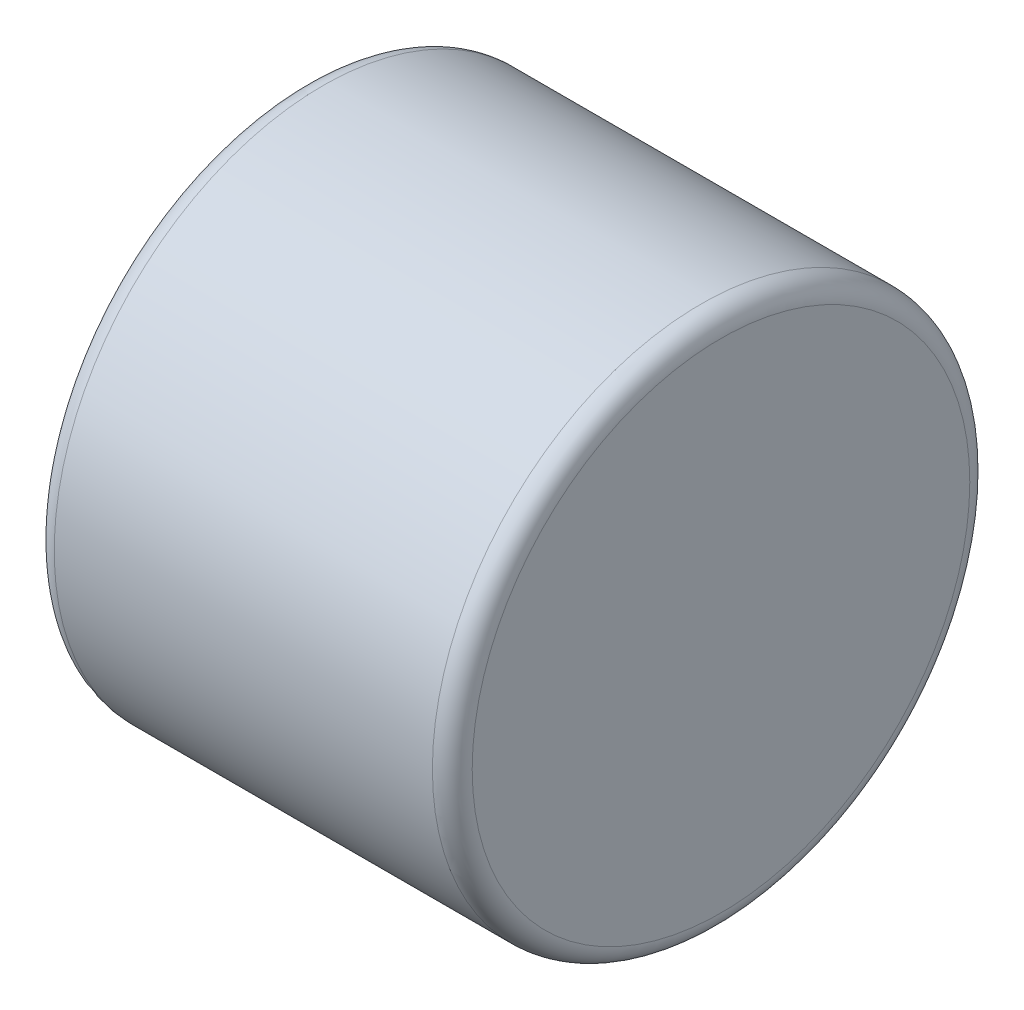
ISO-10303-21;
HEADER;
FILE_DESCRIPTION(('STEP AP214'),'2;1');
FILE_NAME('part.step','',(''),(''),'','','');
FILE_SCHEMA(('AUTOMOTIVE_DESIGN { 1 0 10303 214 1 1 1 1 }'));
ENDSEC;
DATA;
#1=APPLICATION_CONTEXT('core data for automotive mechanical design processes');
#2=APPLICATION_PROTOCOL_DEFINITION('international standard','automotive_design',2000,#1);
#3=PRODUCT_CONTEXT('',#1,'mechanical');
#4=PRODUCT('Part','Part','',(#3));
#5=PRODUCT_RELATED_PRODUCT_CATEGORY('part','',(#4));
#6=PRODUCT_DEFINITION_FORMATION('','',#4);
#7=PRODUCT_DEFINITION_CONTEXT('part definition',#1,'design');
#8=PRODUCT_DEFINITION('design','',#6,#7);
#9=PRODUCT_DEFINITION_SHAPE('','',#8);
#10=(LENGTH_UNIT() NAMED_UNIT(*) SI_UNIT(.MILLI.,.METRE.));
#11=(NAMED_UNIT(*) PLANE_ANGLE_UNIT() SI_UNIT($,.RADIAN.));
#12=(NAMED_UNIT(*) SI_UNIT($,.STERADIAN.) SOLID_ANGLE_UNIT());
#13=UNCERTAINTY_MEASURE_WITH_UNIT(LENGTH_MEASURE(1.E-05),#10,'distance_accuracy_value','');
#14=(GEOMETRIC_REPRESENTATION_CONTEXT(3) GLOBAL_UNCERTAINTY_ASSIGNED_CONTEXT((#13)) GLOBAL_UNIT_ASSIGNED_CONTEXT((#10,
#11,#12)) REPRESENTATION_CONTEXT('',''));
#15=CARTESIAN_POINT('',(0.,0.,0.));
#16=DIRECTION('',(0.,0.,1.));
#17=DIRECTION('',(1.,0.,0.));
#18=AXIS2_PLACEMENT_3D('',#15,#16,#17);
#19=CARTESIAN_POINT('',(-2.1,0.,0.));
#20=DIRECTION('',(1.,0.,0.));
#21=DIRECTION('',(0.,0.,-1.));
#22=AXIS2_PLACEMENT_3D('',#19,#20,#21);
#23=PLANE('',#22);
#24=CARTESIAN_POINT('',(-2.1,0.,0.));
#25=DIRECTION('',(1.,0.,0.));
#26=DIRECTION('',(0.,0.,-1.));
#27=AXIS2_PLACEMENT_3D('',#24,#25,#26);
#28=CIRCLE('',#27,2.5);
#29=CARTESIAN_POINT('',(-2.1,0.,-2.5));
#30=VERTEX_POINT('',#29);
#31=EDGE_CURVE('E10',#30,#30,#28,.F.);
#32=ORIENTED_EDGE('',*,*,#31,.T.);
#33=EDGE_LOOP('',(#32));
#34=FACE_BOUND('',#33,.T.);
#35=ADVANCED_FACE('F29',(#34),#23,.F.);
#36=CARTESIAN_POINT('',(2.1,2.7,0.));
#37=DIRECTION('',(-1.,0.,0.));
#38=DIRECTION('',(0.,0.,1.));
#39=AXIS2_PLACEMENT_3D('',#36,#37,#38);
#40=PLANE('',#39);
#41=CARTESIAN_POINT('',(2.1,0.,0.));
#42=DIRECTION('',(-1.,0.,0.));
#43=DIRECTION('',(0.,0.,1.));
#44=AXIS2_PLACEMENT_3D('',#41,#42,#43);
#45=CIRCLE('',#44,2.5);
#46=CARTESIAN_POINT('',(2.1,0.,2.5));
#47=VERTEX_POINT('',#46);
#48=EDGE_CURVE('E43',#47,#47,#45,.F.);
#49=ORIENTED_EDGE('',*,*,#48,.T.);
#50=EDGE_LOOP('',(#49));
#51=FACE_BOUND('',#50,.T.);
#52=ADVANCED_FACE('F49',(#51),#40,.F.);
#53=CARTESIAN_POINT('',(3.2,0.,0.));
#54=DIRECTION('',(1.,0.,0.));
#55=DIRECTION('',(0.,0.,-1.));
#56=AXIS2_PLACEMENT_3D('',#53,#54,#55);
#57=CYLINDRICAL_SURFACE('',#56,2.7);
#58=CARTESIAN_POINT('',(1.9,0.,0.));
#59=DIRECTION('',(-1.,0.,0.));
#60=DIRECTION('',(0.,0.,1.));
#61=AXIS2_PLACEMENT_3D('',#58,#59,#60);
#62=CIRCLE('',#61,2.7);
#63=CARTESIAN_POINT('',(1.9,0.,2.7));
#64=VERTEX_POINT('',#63);
#65=EDGE_CURVE('E35',#64,#64,#62,.T.);
#66=ORIENTED_EDGE('',*,*,#65,.T.);
#67=EDGE_LOOP('',(#66));
#68=FACE_BOUND('',#67,.T.);
#69=CARTESIAN_POINT('',(-1.9,0.,0.));
#70=DIRECTION('',(1.,0.,0.));
#71=DIRECTION('',(0.,0.,-1.));
#72=AXIS2_PLACEMENT_3D('',#69,#70,#71);
#73=CIRCLE('',#72,2.7);
#74=CARTESIAN_POINT('',(-1.9,0.,-2.7));
#75=VERTEX_POINT('',#74);
#76=EDGE_CURVE('E39',#75,#75,#73,.T.);
#77=ORIENTED_EDGE('',*,*,#76,.T.);
#78=EDGE_LOOP('',(#77));
#79=FACE_BOUND('',#78,.T.);
#80=ADVANCED_FACE('F54',(#68,#79),#57,.T.);
#81=CARTESIAN_POINT('',(1.9,0.,0.));
#82=DIRECTION('',(-1.,0.,0.));
#83=DIRECTION('',(0.,0.,1.));
#84=AXIS2_PLACEMENT_3D('',#81,#82,#83);
#85=TOROIDAL_SURFACE('',#84,2.5,0.2);
#86=ORIENTED_EDGE('',*,*,#65,.F.);
#87=EDGE_LOOP('',(#86));
#88=FACE_BOUND('',#87,.T.);
#89=ORIENTED_EDGE('',*,*,#48,.F.);
#90=EDGE_LOOP('',(#89));
#91=FACE_BOUND('',#90,.T.);
#92=ADVANCED_FACE('F51',(#88,#91),#85,.T.);
#93=CARTESIAN_POINT('',(-1.9,0.,0.));
#94=DIRECTION('',(1.,0.,0.));
#95=DIRECTION('',(0.,0.,-1.));
#96=AXIS2_PLACEMENT_3D('',#93,#94,#95);
#97=TOROIDAL_SURFACE('',#96,2.5,0.2);
#98=ORIENTED_EDGE('',*,*,#31,.F.);
#99=EDGE_LOOP('',(#98));
#100=FACE_BOUND('',#99,.T.);
#101=ORIENTED_EDGE('',*,*,#76,.F.);
#102=EDGE_LOOP('',(#101));
#103=FACE_BOUND('',#102,.T.);
#104=ADVANCED_FACE('F53',(#100,#103),#97,.T.);
#105=CLOSED_SHELL('',(#35,#52,#80,#92,#104));
#106=MANIFOLD_SOLID_BREP('B2',#105);
#107=ADVANCED_BREP_SHAPE_REPRESENTATION('',(#18,#106),#14);
#108=SHAPE_DEFINITION_REPRESENTATION(#9,#107);
ENDSEC;
END-ISO-10303-21;
